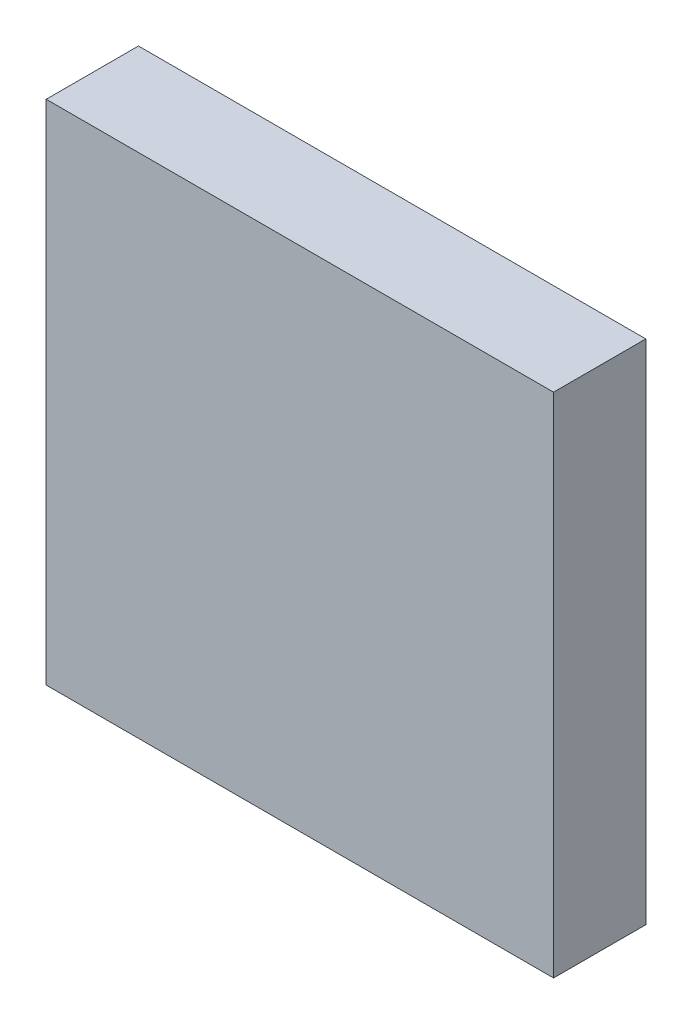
ISO-10303-21;
HEADER;
FILE_DESCRIPTION(('STEP AP214'),'2;1');
FILE_NAME('part.step','',(''),(''),'','','');
FILE_SCHEMA(('AUTOMOTIVE_DESIGN { 1 0 10303 214 1 1 1 1 }'));
ENDSEC;
DATA;
#1=APPLICATION_CONTEXT('core data for automotive mechanical design processes');
#2=APPLICATION_PROTOCOL_DEFINITION('international standard','automotive_design',2000,#1);
#3=PRODUCT_CONTEXT('',#1,'mechanical');
#4=PRODUCT('Part','Part','',(#3));
#5=PRODUCT_RELATED_PRODUCT_CATEGORY('part','',(#4));
#6=PRODUCT_DEFINITION_FORMATION('','',#4);
#7=PRODUCT_DEFINITION_CONTEXT('part definition',#1,'design');
#8=PRODUCT_DEFINITION('design','',#6,#7);
#9=PRODUCT_DEFINITION_SHAPE('','',#8);
#10=(LENGTH_UNIT() NAMED_UNIT(*) SI_UNIT(.MILLI.,.METRE.));
#11=(NAMED_UNIT(*) PLANE_ANGLE_UNIT() SI_UNIT($,.RADIAN.));
#12=(NAMED_UNIT(*) SI_UNIT($,.STERADIAN.) SOLID_ANGLE_UNIT());
#13=UNCERTAINTY_MEASURE_WITH_UNIT(LENGTH_MEASURE(1.E-05),#10,'distance_accuracy_value','');
#14=(GEOMETRIC_REPRESENTATION_CONTEXT(3) GLOBAL_UNCERTAINTY_ASSIGNED_CONTEXT((#13)) GLOBAL_UNIT_ASSIGNED_CONTEXT((#10,
#11,#12)) REPRESENTATION_CONTEXT('',''));
#15=CARTESIAN_POINT('',(0.,0.,0.));
#16=DIRECTION('',(0.,0.,1.));
#17=DIRECTION('',(1.,0.,0.));
#18=AXIS2_PLACEMENT_3D('',#15,#16,#17);
#19=CARTESIAN_POINT('',(0.,0.,20.));
#20=DIRECTION('',(0.,0.,1.));
#21=DIRECTION('',(1.,0.,0.));
#22=AXIS2_PLACEMENT_3D('',#19,#20,#21);
#23=PLANE('',#22);
#24=DIRECTION('',(1.,0.,0.));
#25=VECTOR('',#24,1.);
#26=CARTESIAN_POINT('',(-55.,-55.,20.));
#27=LINE('',#26,#25);
#28=CARTESIAN_POINT('',(-55.,-55.,20.));
#29=VERTEX_POINT('',#28);
#30=CARTESIAN_POINT('',(55.,-55.,20.));
#31=VERTEX_POINT('',#30);
#32=EDGE_CURVE('E80',#29,#31,#27,.T.);
#33=ORIENTED_EDGE('',*,*,#32,.T.);
#34=DIRECTION('',(0.,1.,0.));
#35=VECTOR('',#34,1.);
#36=CARTESIAN_POINT('',(55.,-55.,20.));
#37=LINE('',#36,#35);
#38=CARTESIAN_POINT('',(55.,55.,20.));
#39=VERTEX_POINT('',#38);
#40=EDGE_CURVE('E102',#31,#39,#37,.T.);
#41=ORIENTED_EDGE('',*,*,#40,.T.);
#42=DIRECTION('',(-1.,0.,0.));
#43=VECTOR('',#42,1.);
#44=CARTESIAN_POINT('',(55.,55.,20.));
#45=LINE('',#44,#43);
#46=CARTESIAN_POINT('',(-55.,55.,20.));
#47=VERTEX_POINT('',#46);
#48=EDGE_CURVE('E73',#39,#47,#45,.T.);
#49=ORIENTED_EDGE('',*,*,#48,.T.);
#50=DIRECTION('',(0.,-1.,0.));
#51=VECTOR('',#50,1.);
#52=CARTESIAN_POINT('',(-55.,55.,20.));
#53=LINE('',#52,#51);
#54=EDGE_CURVE('E10',#47,#29,#53,.T.);
#55=ORIENTED_EDGE('',*,*,#54,.T.);
#56=EDGE_LOOP('',(#33,#41,#49,#55));
#57=FACE_BOUND('',#56,.T.);
#58=ADVANCED_FACE('F16',(#57),#23,.T.);
#59=CARTESIAN_POINT('',(0.,0.,0.));
#60=DIRECTION('',(0.,0.,1.));
#61=DIRECTION('',(1.,0.,0.));
#62=AXIS2_PLACEMENT_3D('',#59,#60,#61);
#63=PLANE('',#62);
#64=DIRECTION('',(0.,-1.,0.));
#65=VECTOR('',#64,1.);
#66=CARTESIAN_POINT('',(-55.,55.,0.));
#67=LINE('',#66,#65);
#68=CARTESIAN_POINT('',(-55.,55.,0.));
#69=VERTEX_POINT('',#68);
#70=CARTESIAN_POINT('',(-55.,-55.,0.));
#71=VERTEX_POINT('',#70);
#72=EDGE_CURVE('E19',#69,#71,#67,.T.);
#73=ORIENTED_EDGE('',*,*,#72,.F.);
#74=DIRECTION('',(-1.,0.,0.));
#75=VECTOR('',#74,1.);
#76=CARTESIAN_POINT('',(55.,55.,0.));
#77=LINE('',#76,#75);
#78=CARTESIAN_POINT('',(55.,55.,0.));
#79=VERTEX_POINT('',#78);
#80=EDGE_CURVE('E103',#79,#69,#77,.T.);
#81=ORIENTED_EDGE('',*,*,#80,.F.);
#82=DIRECTION('',(0.,1.,0.));
#83=VECTOR('',#82,1.);
#84=CARTESIAN_POINT('',(55.,-55.,0.));
#85=LINE('',#84,#83);
#86=CARTESIAN_POINT('',(55.,-55.,0.));
#87=VERTEX_POINT('',#86);
#88=EDGE_CURVE('E82',#87,#79,#85,.T.);
#89=ORIENTED_EDGE('',*,*,#88,.F.);
#90=DIRECTION('',(1.,0.,0.));
#91=VECTOR('',#90,1.);
#92=CARTESIAN_POINT('',(-55.,-55.,0.));
#93=LINE('',#92,#91);
#94=EDGE_CURVE('E78',#71,#87,#93,.T.);
#95=ORIENTED_EDGE('',*,*,#94,.F.);
#96=EDGE_LOOP('',(#73,#81,#89,#95));
#97=FACE_BOUND('',#96,.T.);
#98=ADVANCED_FACE('F84',(#97),#63,.F.);
#99=CARTESIAN_POINT('',(-55.,55.,0.));
#100=DIRECTION('',(1.,0.,0.));
#101=DIRECTION('',(0.,1.,0.));
#102=AXIS2_PLACEMENT_3D('',#99,#100,#101);
#103=PLANE('',#102);
#104=ORIENTED_EDGE('',*,*,#72,.T.);
#105=DIRECTION('',(0.,0.,1.));
#106=VECTOR('',#105,1.);
#107=CARTESIAN_POINT('',(-55.,-55.,0.));
#108=LINE('',#107,#106);
#109=EDGE_CURVE('E67',#71,#29,#108,.T.);
#110=ORIENTED_EDGE('',*,*,#109,.T.);
#111=ORIENTED_EDGE('',*,*,#54,.F.);
#112=DIRECTION('',(0.,0.,1.));
#113=VECTOR('',#112,1.);
#114=CARTESIAN_POINT('',(-55.,55.,0.));
#115=LINE('',#114,#113);
#116=EDGE_CURVE('E70',#69,#47,#115,.T.);
#117=ORIENTED_EDGE('',*,*,#116,.F.);
#118=EDGE_LOOP('',(#104,#110,#111,#117));
#119=FACE_BOUND('',#118,.T.);
#120=ADVANCED_FACE('F66',(#119),#103,.F.);
#121=CARTESIAN_POINT('',(55.,55.,0.));
#122=DIRECTION('',(0.,-1.,0.));
#123=DIRECTION('',(0.,0.,-1.));
#124=AXIS2_PLACEMENT_3D('',#121,#122,#123);
#125=PLANE('',#124);
#126=ORIENTED_EDGE('',*,*,#80,.T.);
#127=ORIENTED_EDGE('',*,*,#116,.T.);
#128=ORIENTED_EDGE('',*,*,#48,.F.);
#129=DIRECTION('',(0.,0.,1.));
#130=VECTOR('',#129,1.);
#131=CARTESIAN_POINT('',(55.,55.,0.));
#132=LINE('',#131,#130);
#133=EDGE_CURVE('E97',#79,#39,#132,.T.);
#134=ORIENTED_EDGE('',*,*,#133,.F.);
#135=EDGE_LOOP('',(#126,#127,#128,#134));
#136=FACE_BOUND('',#135,.T.);
#137=ADVANCED_FACE('F113',(#136),#125,.F.);
#138=CARTESIAN_POINT('',(55.,-55.,0.));
#139=DIRECTION('',(-1.,0.,0.));
#140=DIRECTION('',(0.,0.,1.));
#141=AXIS2_PLACEMENT_3D('',#138,#139,#140);
#142=PLANE('',#141);
#143=ORIENTED_EDGE('',*,*,#88,.T.);
#144=ORIENTED_EDGE('',*,*,#133,.T.);
#145=ORIENTED_EDGE('',*,*,#40,.F.);
#146=DIRECTION('',(0.,0.,1.));
#147=VECTOR('',#146,1.);
#148=CARTESIAN_POINT('',(55.,-55.,0.));
#149=LINE('',#148,#147);
#150=EDGE_CURVE('E88',#87,#31,#149,.T.);
#151=ORIENTED_EDGE('',*,*,#150,.F.);
#152=EDGE_LOOP('',(#143,#144,#145,#151));
#153=FACE_BOUND('',#152,.T.);
#154=ADVANCED_FACE('F116',(#153),#142,.F.);
#155=CARTESIAN_POINT('',(-55.,-55.,0.));
#156=DIRECTION('',(0.,1.,0.));
#157=DIRECTION('',(1.,0.,0.));
#158=AXIS2_PLACEMENT_3D('',#155,#156,#157);
#159=PLANE('',#158);
#160=ORIENTED_EDGE('',*,*,#94,.T.);
#161=ORIENTED_EDGE('',*,*,#150,.T.);
#162=ORIENTED_EDGE('',*,*,#32,.F.);
#163=ORIENTED_EDGE('',*,*,#109,.F.);
#164=EDGE_LOOP('',(#160,#161,#162,#163));
#165=FACE_BOUND('',#164,.T.);
#166=ADVANCED_FACE('F76',(#165),#159,.F.);
#167=CLOSED_SHELL('',(#58,#98,#120,#137,#154,#166));
#168=MANIFOLD_SOLID_BREP('B1',#167);
#169=ADVANCED_BREP_SHAPE_REPRESENTATION('',(#18,#168),#14);
#170=SHAPE_DEFINITION_REPRESENTATION(#9,#169);
ENDSEC;
END-ISO-10303-21;
